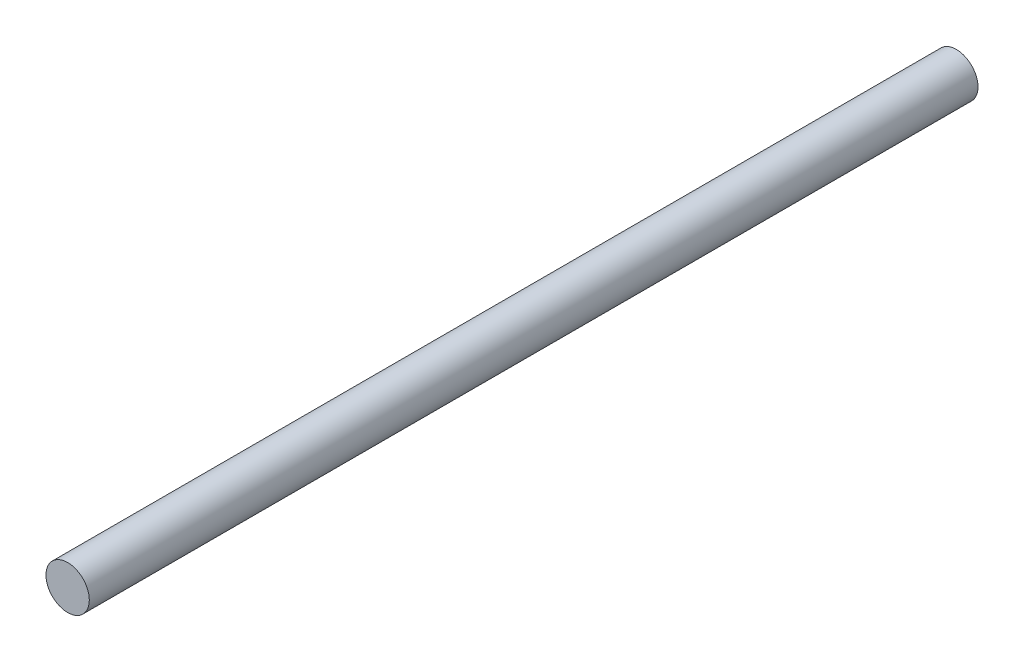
from build123d import *

# Parameters (mm, degrees)
ESQUISSE1_R      = 1
EXTRUSION1_DEPTH = 41


with BuildPart() as part:
    # Esquisse1 → Extrusion1 (new body)
    with BuildSketch(Plane.XY):
        Circle(ESQUISSE1_R)
    extrude(amount=EXTRUSION1_DEPTH)


solid = part.part
